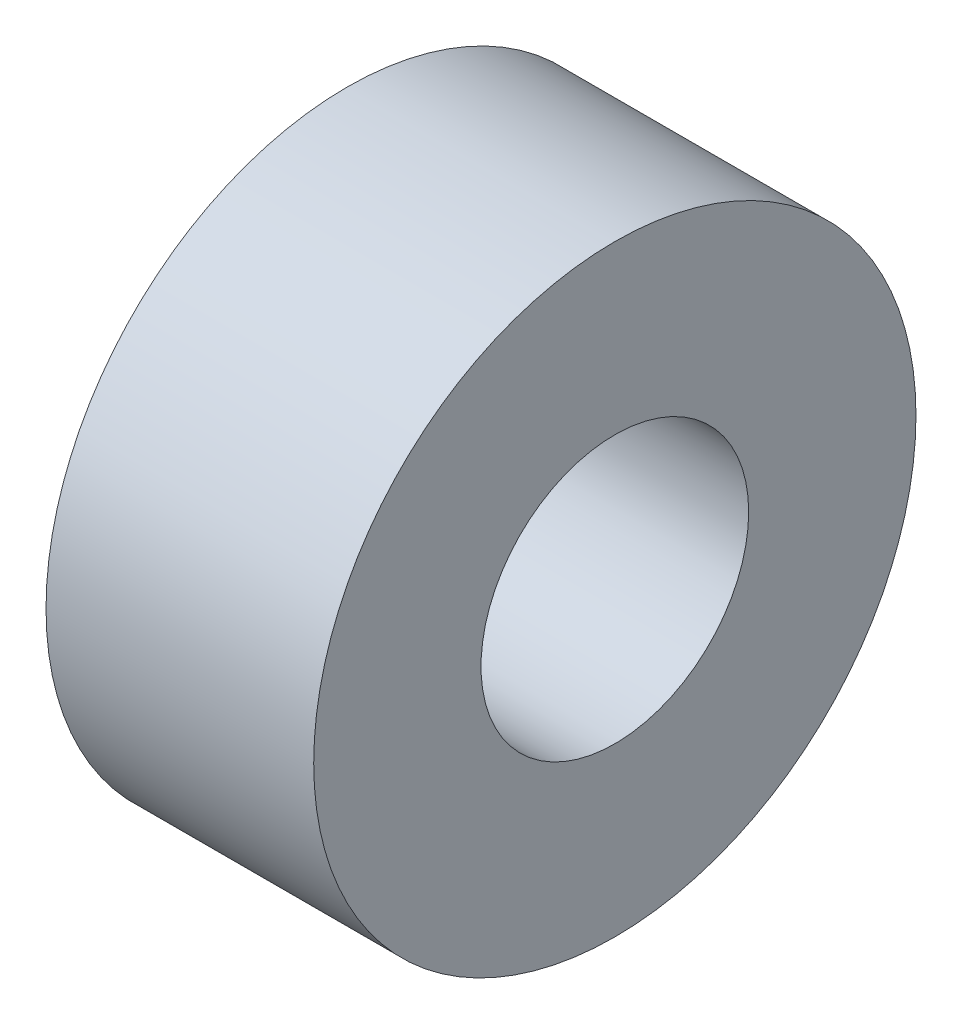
from build123d import *

# Parameters (mm, degrees)
ESBO_O1_R                = 4.5
ESBO_O1_R_2              = 2
RESSALTO_EXTRUS_O1_DEPTH = 4


with BuildPart() as part:
    # Esbo_o1 → Ressalto-extrus_o1 (new body)
    with BuildSketch(Plane(origin=(0, 0, 0), x_dir=(0, 0, -1), z_dir=(1, 0, 0))):
        Circle(ESBO_O1_R)
        Circle(ESBO_O1_R_2, mode=Mode.SUBTRACT)
    extrude(amount=RESSALTO_EXTRUS_O1_DEPTH)


solid = part.part
